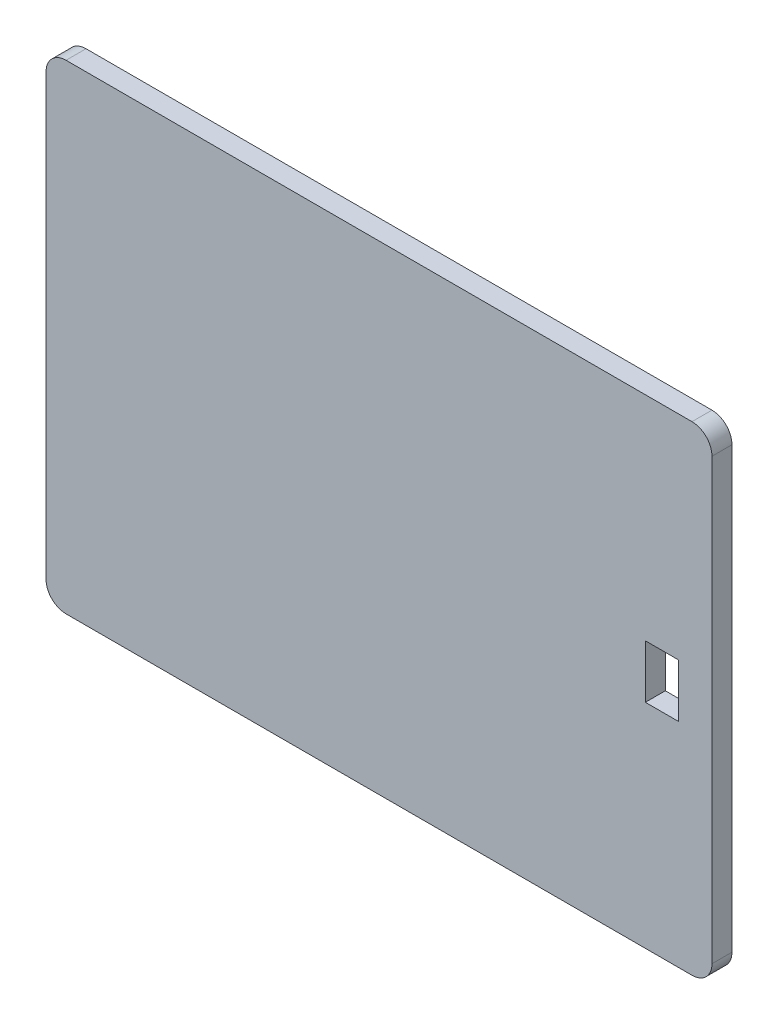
from build123d import *

# Parameters (mm, degrees)
EXTRUSION1_DEPTH        = 3
ESQUISSE2_W             = 5
ESQUISSE2_H             = 8
ENL_V_MAT_EXTRU_1_DEPTH = 124.259888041


with BuildPart() as part:
    # Esquisse1 → Extrusion1 (new body)
    with BuildSketch(Plane.XY):
        with BuildLine():
            Line((3, 0), (97, 0))
            ThreePointArc((97, 0), (99.121320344, 0.878679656), (100, 3))
            Line((100, 3), (100, 69))
            ThreePointArc((100, 69), (99.121320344, 71.121320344), (97, 72))
            Line((97, 72), (3, 72))
            ThreePointArc((3, 72), (0.878679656, 71.121320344), (0, 69))
            Line((0, 69), (0, 3))
            ThreePointArc((0, 3), (0.878679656, 0.878679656), (3, 0))
        make_face()
    extrude(amount=EXTRUSION1_DEPTH)

    # Esquisse2 → Enl_v. mat.-Extru.1 (cut, through all)
    with BuildSketch(Plane.XY.offset(3)):
        with Locations((92.5, 36)):
            Rectangle(ESQUISSE2_W, ESQUISSE2_H)
    extrude(amount=-ENL_V_MAT_EXTRU_1_DEPTH, mode=Mode.SUBTRACT)


solid = part.part
